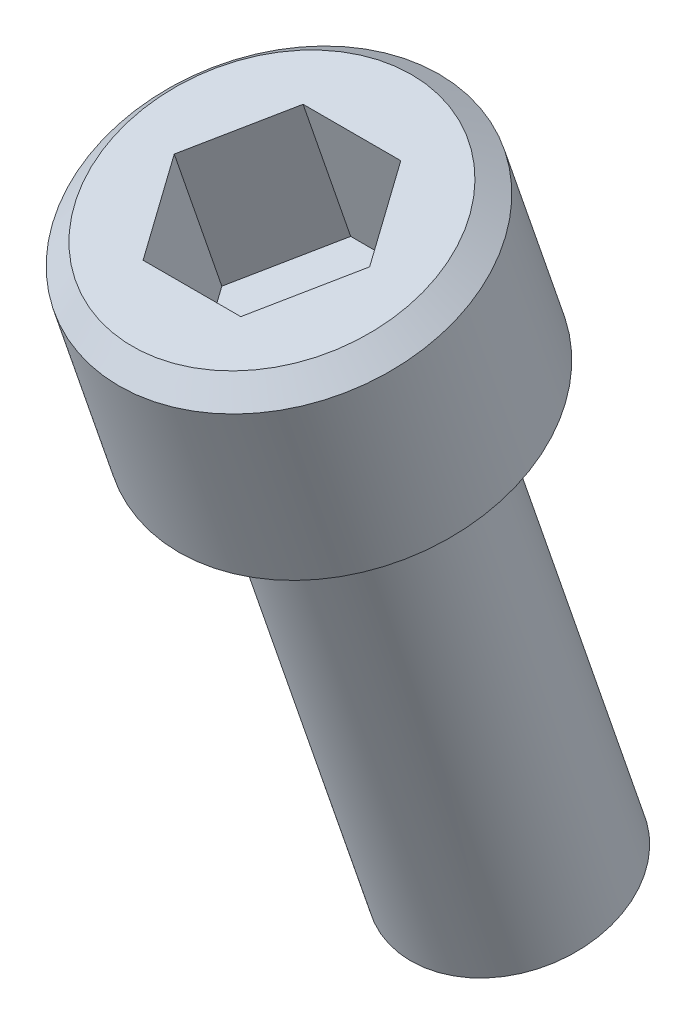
ISO-10303-21;
HEADER;
FILE_DESCRIPTION(('STEP AP214'),'2;1');
FILE_NAME('part.step','',(''),(''),'','','');
FILE_SCHEMA(('AUTOMOTIVE_DESIGN { 1 0 10303 214 1 1 1 1 }'));
ENDSEC;
DATA;
#1=APPLICATION_CONTEXT('core data for automotive mechanical design processes');
#2=APPLICATION_PROTOCOL_DEFINITION('international standard','automotive_design',2000,#1);
#3=PRODUCT_CONTEXT('',#1,'mechanical');
#4=PRODUCT('Part','Part','',(#3));
#5=PRODUCT_RELATED_PRODUCT_CATEGORY('part','',(#4));
#6=PRODUCT_DEFINITION_FORMATION('','',#4);
#7=PRODUCT_DEFINITION_CONTEXT('part definition',#1,'design');
#8=PRODUCT_DEFINITION('design','',#6,#7);
#9=PRODUCT_DEFINITION_SHAPE('','',#8);
#10=(LENGTH_UNIT() NAMED_UNIT(*) SI_UNIT(.MILLI.,.METRE.));
#11=(NAMED_UNIT(*) PLANE_ANGLE_UNIT() SI_UNIT($,.RADIAN.));
#12=(NAMED_UNIT(*) SI_UNIT($,.STERADIAN.) SOLID_ANGLE_UNIT());
#13=UNCERTAINTY_MEASURE_WITH_UNIT(LENGTH_MEASURE(1.E-05),#10,'distance_accuracy_value','');
#14=(GEOMETRIC_REPRESENTATION_CONTEXT(3) GLOBAL_UNCERTAINTY_ASSIGNED_CONTEXT((#13)) GLOBAL_UNIT_ASSIGNED_CONTEXT((#10,
#11,#12)) REPRESENTATION_CONTEXT('',''));
#15=CARTESIAN_POINT('',(0.,0.,0.));
#16=DIRECTION('',(0.,0.,1.));
#17=DIRECTION('',(1.,0.,0.));
#18=AXIS2_PLACEMENT_3D('',#15,#16,#17);
#19=CARTESIAN_POINT('',(-783.822223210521,-239.976630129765,-477.462884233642));
#20=DIRECTION('',(0.,-0.945518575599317,-0.325568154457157));
#21=DIRECTION('',(0.,0.325568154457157,-0.945518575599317));
#22=AXIS2_PLACEMENT_3D('',#19,#20,#21);
#23=PLANE('',#22);
#24=CARTESIAN_POINT('',(-783.822223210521,-239.976630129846,-477.46288423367));
#25=DIRECTION('',(0.,0.945518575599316,0.325568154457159));
#26=DIRECTION('',(0.,-0.325568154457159,0.945518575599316));
#27=AXIS2_PLACEMENT_3D('',#24,#25,#26);
#28=CIRCLE('',#27,1.90499999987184);
#29=CARTESIAN_POINT('',(-783.822223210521,-239.356422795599,-479.264097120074));
#30=VERTEX_POINT('',#29);
#31=CARTESIAN_POINT('',(-783.822223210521,-240.596837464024,-475.661671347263));
#32=VERTEX_POINT('',#31);
#33=EDGE_CURVE('E89',#30,#32,#28,.T.);
#34=ORIENTED_EDGE('',*,*,#33,.F.);
#35=CARTESIAN_POINT('',(-783.822223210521,-239.976630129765,-477.462884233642));
#36=DIRECTION('',(0.,0.945518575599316,0.325568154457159));
#37=DIRECTION('',(0.,-0.325568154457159,0.945518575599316));
#38=AXIS2_PLACEMENT_3D('',#35,#36,#37);
#39=CIRCLE('',#38,1.90499999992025);
#40=EDGE_CURVE('E78',#32,#30,#39,.T.);
#41=ORIENTED_EDGE('',*,*,#40,.F.);
#42=EDGE_LOOP('',(#34,#41));
#43=FACE_BOUND('',#42,.T.);
#44=ADVANCED_FACE('F38',(#43),#23,.T.);
#45=CARTESIAN_POINT('',(-783.822223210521,-239.496306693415,-477.297495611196));
#46=DIRECTION('',(0.,0.945518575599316,0.325568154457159));
#47=DIRECTION('',(0.,-0.325568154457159,0.945518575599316));
#48=AXIS2_PLACEMENT_3D('',#45,#46,#47);
#49=CONICAL_SURFACE('',#48,2.41299999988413,0.785398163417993);
#50=DIRECTION('',(0.,-0.898794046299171,0.43837114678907));
#51=VECTOR('',#50,1.);
#52=CARTESIAN_POINT('',(-783.822223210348,499236.305248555,-244089.821489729));
#53=LINE('',#52,#51);
#54=CARTESIAN_POINT('',(-783.822223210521,-238.710710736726,-479.579031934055));
#55=VERTEX_POINT('',#54);
#56=EDGE_CURVE('E83',#55,#30,#53,.T.);
#57=ORIENTED_EDGE('',*,*,#56,.F.);
#58=CARTESIAN_POINT('',(-783.822223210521,-239.49630669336,-477.297495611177));
#59=DIRECTION('',(0.,0.945518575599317,0.325568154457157));
#60=DIRECTION('',(0.,0.32556815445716,-0.945518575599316));
#61=AXIS2_PLACEMENT_3D('',#58,#59,#60);
#62=CIRCLE('',#61,2.413);
#63=CARTESIAN_POINT('',(-783.822223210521,-240.28190265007,-475.015959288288));
#64=VERTEX_POINT('',#63);
#65=EDGE_CURVE('E91',#64,#55,#62,.T.);
#66=ORIENTED_EDGE('',*,*,#65,.F.);
#67=DIRECTION('',(0.,-0.438371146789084,-0.898794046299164));
#68=VECTOR('',#67,1.);
#69=CARTESIAN_POINT('',(-783.822223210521,243369.960555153,499000.));
#70=LINE('',#69,#68);
#71=EDGE_CURVE('E86',#32,#64,#70,.F.);
#72=ORIENTED_EDGE('',*,*,#71,.F.);
#73=ORIENTED_EDGE('',*,*,#40,.T.);
#74=EDGE_LOOP('',(#57,#66,#72,#73));
#75=FACE_BOUND('',#74,.T.);
#76=ADVANCED_FACE('F81',(#75),#49,.T.);
#77=CARTESIAN_POINT('',(-783.822223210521,-239.496306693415,-477.297495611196));
#78=DIRECTION('',(0.,0.945518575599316,0.325568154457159));
#79=DIRECTION('',(0.,-0.325568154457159,0.945518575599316));
#80=AXIS2_PLACEMENT_3D('',#77,#78,#79);
#81=CONICAL_SURFACE('',#80,2.41299999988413,0.785398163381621);
#82=ORIENTED_EDGE('',*,*,#56,.T.);
#83=ORIENTED_EDGE('',*,*,#33,.T.);
#84=ORIENTED_EDGE('',*,*,#71,.T.);
#85=CARTESIAN_POINT('',(-783.822223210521,-239.49630669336,-477.297495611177));
#86=DIRECTION('',(0.,0.945518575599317,0.325568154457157));
#87=DIRECTION('',(0.,0.32556815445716,-0.945518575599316));
#88=AXIS2_PLACEMENT_3D('',#85,#86,#87);
#89=CIRCLE('',#88,2.413);
#90=EDGE_CURVE('E96',#55,#64,#89,.T.);
#91=ORIENTED_EDGE('',*,*,#90,.F.);
#92=EDGE_LOOP('',(#82,#83,#84,#91));
#93=FACE_BOUND('',#92,.T.);
#94=ADVANCED_FACE('F94',(#93),#81,.T.);
#95=CARTESIAN_POINT('',(-783.822223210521,-226.647654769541,-472.873349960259));
#96=DIRECTION('',(0.,-0.945518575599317,-0.325568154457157));
#97=DIRECTION('',(0.,0.325568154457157,-0.945518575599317));
#98=AXIS2_PLACEMENT_3D('',#95,#96,#97);
#99=PLANE('',#98);
#100=DIRECTION('',(-0.499999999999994,-0.281950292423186,0.818843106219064));
#101=VECTOR('',#100,1.);
#102=CARTESIAN_POINT('',(-784.967902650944,-226.00160546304,-474.749613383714));
#103=LINE('',#102,#101);
#104=CARTESIAN_POINT('',(-784.967902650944,-226.00160546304,-474.749613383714));
#105=VERTEX_POINT('',#104);
#106=CARTESIAN_POINT('',(-786.113582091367,-226.647654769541,-472.873349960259));
#107=VERTEX_POINT('',#106);
#108=EDGE_CURVE('E218',#105,#107,#103,.T.);
#109=ORIENTED_EDGE('',*,*,#108,.T.);
#110=DIRECTION('',(0.500000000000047,-0.281950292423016,0.81884310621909));
#111=VECTOR('',#110,1.);
#112=CARTESIAN_POINT('',(-786.113582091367,-226.647654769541,-472.873349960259));
#113=LINE('',#112,#111);
#114=CARTESIAN_POINT('',(-784.967902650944,-227.293704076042,-470.997086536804));
#115=VERTEX_POINT('',#114);
#116=EDGE_CURVE('E212',#107,#115,#113,.T.);
#117=ORIENTED_EDGE('',*,*,#116,.T.);
#118=DIRECTION('',(1.,0.,0.));
#119=VECTOR('',#118,1.);
#120=CARTESIAN_POINT('',(-782.676543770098,-227.293704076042,-470.997086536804));
#121=LINE('',#120,#119);
#122=CARTESIAN_POINT('',(-782.676543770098,-227.293704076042,-470.997086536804));
#123=VERTEX_POINT('',#122);
#124=EDGE_CURVE('E207',#115,#123,#121,.T.);
#125=ORIENTED_EDGE('',*,*,#124,.T.);
#126=DIRECTION('',(0.500000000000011,0.281950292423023,-0.81884310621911));
#127=VECTOR('',#126,1.);
#128=CARTESIAN_POINT('',(-782.676543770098,-227.293704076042,-470.997086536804));
#129=LINE('',#128,#127);
#130=CARTESIAN_POINT('',(-781.530864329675,-226.647654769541,-472.873349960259));
#131=VERTEX_POINT('',#130);
#132=EDGE_CURVE('E195',#123,#131,#129,.T.);
#133=ORIENTED_EDGE('',*,*,#132,.T.);
#134=DIRECTION('',(-0.499999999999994,0.281950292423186,-0.818843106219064));
#135=VECTOR('',#134,1.);
#136=CARTESIAN_POINT('',(-781.530864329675,-226.647654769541,-472.873349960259));
#137=LINE('',#136,#135);
#138=CARTESIAN_POINT('',(-782.676543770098,-226.00160546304,-474.749613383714));
#139=VERTEX_POINT('',#138);
#140=EDGE_CURVE('E191',#131,#139,#137,.T.);
#141=ORIENTED_EDGE('',*,*,#140,.T.);
#142=DIRECTION('',(1.,0.,0.));
#143=VECTOR('',#142,1.);
#144=CARTESIAN_POINT('',(-784.967902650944,-226.00160546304,-474.749613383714));
#145=LINE('',#144,#143);
#146=EDGE_CURVE('E181',#139,#105,#145,.F.);
#147=ORIENTED_EDGE('',*,*,#146,.T.);
#148=EDGE_LOOP('',(#109,#117,#125,#133,#141,#147));
#149=FACE_BOUND('',#148,.T.);
#150=ADVANCED_FACE('F259',(#149),#99,.F.);
#151=CARTESIAN_POINT('',(-783.822223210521,-239.49630669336,-477.297495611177));
#152=DIRECTION('',(0.,0.945518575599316,0.325568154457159));
#153=DIRECTION('',(0.,-0.325568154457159,0.945518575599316));
#154=AXIS2_PLACEMENT_3D('',#151,#152,#153);
#155=CYLINDRICAL_SURFACE('',#154,2.41300000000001);
#156=ORIENTED_EDGE('',*,*,#65,.T.);
#157=ORIENTED_EDGE('',*,*,#90,.T.);
#158=EDGE_LOOP('',(#156,#157));
#159=FACE_BOUND('',#158,.T.);
#160=CARTESIAN_POINT('',(-783.822223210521,-228.304770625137,-473.443940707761));
#161=DIRECTION('',(0.,0.945518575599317,0.325568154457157));
#162=DIRECTION('',(0.,0.325568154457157,-0.945518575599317));
#163=AXIS2_PLACEMENT_3D('',#160,#161,#162);
#164=CIRCLE('',#163,2.41299999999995);
#165=CARTESIAN_POINT('',(-783.822223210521,-227.519174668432,-475.725477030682));
#166=VERTEX_POINT('',#165);
#167=EDGE_CURVE('E175',#166,#166,#164,.T.);
#168=ORIENTED_EDGE('',*,*,#167,.F.);
#169=EDGE_LOOP('',(#168));
#170=FACE_BOUND('',#169,.T.);
#171=ADVANCED_FACE('F255',(#159,#170),#155,.T.);
#172=CARTESIAN_POINT('',(-782.676543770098,-226.00160546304,-474.749613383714));
#173=DIRECTION('',(0.866025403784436,0.16278407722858,-0.472759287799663));
#174=DIRECTION('',(-0.479150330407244,0.,-0.877732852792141));
#175=AXIS2_PLACEMENT_3D('',#172,#173,#174);
#176=PLANE('',#175);
#177=DIRECTION('',(0.,0.945518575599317,0.325568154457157));
#178=VECTOR('',#177,1.);
#179=CARTESIAN_POINT('',(-782.676543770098,-226.00160546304,-474.749613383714));
#180=LINE('',#179,#178);
#181=CARTESIAN_POINT('',(-782.676543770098,-222.75942226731,-473.63324018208));
#182=VERTEX_POINT('',#181);
#183=EDGE_CURVE('E224',#182,#139,#180,.F.);
#184=ORIENTED_EDGE('',*,*,#183,.T.);
#185=ORIENTED_EDGE('',*,*,#140,.F.);
#186=DIRECTION('',(0.,0.945518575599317,0.325568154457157));
#187=VECTOR('',#186,1.);
#188=CARTESIAN_POINT('',(-781.530864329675,-226.647654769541,-472.873349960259));
#189=LINE('',#188,#187);
#190=CARTESIAN_POINT('',(-781.530864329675,-223.405471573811,-471.756976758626));
#191=VERTEX_POINT('',#190);
#192=EDGE_CURVE('E203',#131,#191,#189,.T.);
#193=ORIENTED_EDGE('',*,*,#192,.T.);
#194=DIRECTION('',(0.499999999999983,-0.281950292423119,0.818843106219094));
#195=VECTOR('',#194,1.);
#196=CARTESIAN_POINT('',(-782.676543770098,-222.75942226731,-473.63324018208));
#197=LINE('',#196,#195);
#198=EDGE_CURVE('E174',#182,#191,#197,.T.);
#199=ORIENTED_EDGE('',*,*,#198,.F.);
#200=EDGE_LOOP('',(#184,#185,#193,#199));
#201=FACE_BOUND('',#200,.T.);
#202=ADVANCED_FACE('F251',(#201),#176,.F.);
#203=CARTESIAN_POINT('',(-781.530864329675,-226.647654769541,-472.873349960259));
#204=DIRECTION('',(0.866025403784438,-0.162784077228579,0.47275928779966));
#205=DIRECTION('',(0.47915033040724,0.,-0.877732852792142));
#206=AXIS2_PLACEMENT_3D('',#203,#204,#205);
#207=PLANE('',#206);
#208=ORIENTED_EDGE('',*,*,#192,.F.);
#209=ORIENTED_EDGE('',*,*,#132,.F.);
#210=DIRECTION('',(0.,-0.945518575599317,-0.325568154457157));
#211=VECTOR('',#210,1.);
#212=CARTESIAN_POINT('',(-782.676543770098,-227.293704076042,-470.997086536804));
#213=LINE('',#212,#211);
#214=CARTESIAN_POINT('',(-782.676543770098,-224.051520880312,-469.880713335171));
#215=VERTEX_POINT('',#214);
#216=EDGE_CURVE('E209',#123,#215,#213,.F.);
#217=ORIENTED_EDGE('',*,*,#216,.T.);
#218=DIRECTION('',(-0.499999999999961,-0.281950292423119,0.818843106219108));
#219=VECTOR('',#218,1.);
#220=CARTESIAN_POINT('',(-781.530864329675,-223.405471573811,-471.756976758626));
#221=LINE('',#220,#219);
#222=EDGE_CURVE('E171',#191,#215,#221,.T.);
#223=ORIENTED_EDGE('',*,*,#222,.F.);
#224=EDGE_LOOP('',(#208,#209,#217,#223));
#225=FACE_BOUND('',#224,.T.);
#226=ADVANCED_FACE('F247',(#225),#207,.F.);
#227=CARTESIAN_POINT('',(-782.676543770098,-227.293704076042,-470.997086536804));
#228=DIRECTION('',(0.,-0.325568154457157,0.945518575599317));
#229=DIRECTION('',(0.,-0.945518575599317,-0.325568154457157));
#230=AXIS2_PLACEMENT_3D('',#227,#228,#229);
#231=PLANE('',#230);
#232=ORIENTED_EDGE('',*,*,#216,.F.);
#233=ORIENTED_EDGE('',*,*,#124,.F.);
#234=DIRECTION('',(0.,0.945518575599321,0.325568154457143));
#235=VECTOR('',#234,1.);
#236=CARTESIAN_POINT('',(-784.967902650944,-227.293704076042,-470.997086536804));
#237=LINE('',#236,#235);
#238=CARTESIAN_POINT('',(-784.967902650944,-224.051520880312,-469.880713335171));
#239=VERTEX_POINT('',#238);
#240=EDGE_CURVE('E215',#115,#239,#237,.T.);
#241=ORIENTED_EDGE('',*,*,#240,.T.);
#242=DIRECTION('',(1.,0.,0.));
#243=VECTOR('',#242,1.);
#244=CARTESIAN_POINT('',(-783.822223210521,-224.051520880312,-469.880713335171));
#245=LINE('',#244,#243);
#246=EDGE_CURVE('E166',#215,#239,#245,.F.);
#247=ORIENTED_EDGE('',*,*,#246,.F.);
#248=EDGE_LOOP('',(#232,#233,#241,#247));
#249=FACE_BOUND('',#248,.T.);
#250=ADVANCED_FACE('F243',(#249),#231,.F.);
#251=CARTESIAN_POINT('',(-784.967902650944,-227.293704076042,-470.997086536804));
#252=DIRECTION('',(-0.866025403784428,-0.162784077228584,0.472759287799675));
#253=DIRECTION('',(0.479150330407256,0.,0.877732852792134));
#254=AXIS2_PLACEMENT_3D('',#251,#252,#253);
#255=PLANE('',#254);
#256=ORIENTED_EDGE('',*,*,#240,.F.);
#257=ORIENTED_EDGE('',*,*,#116,.F.);
#258=DIRECTION('',(0.,0.945518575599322,0.325568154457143));
#259=VECTOR('',#258,1.);
#260=CARTESIAN_POINT('',(-786.113582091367,-226.647654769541,-472.873349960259));
#261=LINE('',#260,#259);
#262=CARTESIAN_POINT('',(-786.113582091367,-223.405471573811,-471.756976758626));
#263=VERTEX_POINT('',#262);
#264=EDGE_CURVE('E221',#107,#263,#261,.T.);
#265=ORIENTED_EDGE('',*,*,#264,.T.);
#266=DIRECTION('',(-0.499999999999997,0.281950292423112,-0.818843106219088));
#267=VECTOR('',#266,1.);
#268=CARTESIAN_POINT('',(-784.967902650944,-224.051520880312,-469.880713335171));
#269=LINE('',#268,#267);
#270=EDGE_CURVE('E159',#239,#263,#269,.T.);
#271=ORIENTED_EDGE('',*,*,#270,.F.);
#272=EDGE_LOOP('',(#256,#257,#265,#271));
#273=FACE_BOUND('',#272,.T.);
#274=ADVANCED_FACE('F240',(#273),#255,.F.);
#275=CARTESIAN_POINT('',(-786.113582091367,-226.647654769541,-472.873349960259));
#276=DIRECTION('',(-0.866025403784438,0.162784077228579,-0.47275928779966));
#277=DIRECTION('',(-0.47915033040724,0.,0.877732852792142));
#278=AXIS2_PLACEMENT_3D('',#275,#276,#277);
#279=PLANE('',#278);
#280=ORIENTED_EDGE('',*,*,#264,.F.);
#281=ORIENTED_EDGE('',*,*,#108,.F.);
#282=DIRECTION('',(0.,0.945518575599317,0.325568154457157));
#283=VECTOR('',#282,1.);
#284=CARTESIAN_POINT('',(-784.967902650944,-226.00160546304,-474.749613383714));
#285=LINE('',#284,#283);
#286=CARTESIAN_POINT('',(-784.967902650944,-222.75942226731,-473.63324018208));
#287=VERTEX_POINT('',#286);
#288=EDGE_CURVE('E178',#105,#287,#285,.T.);
#289=ORIENTED_EDGE('',*,*,#288,.T.);
#290=DIRECTION('',(0.500000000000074,0.281950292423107,-0.818843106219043));
#291=VECTOR('',#290,1.);
#292=CARTESIAN_POINT('',(-786.113582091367,-223.405471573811,-471.756976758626));
#293=LINE('',#292,#291);
#294=EDGE_CURVE('E152',#263,#287,#293,.T.);
#295=ORIENTED_EDGE('',*,*,#294,.F.);
#296=EDGE_LOOP('',(#280,#281,#289,#295));
#297=FACE_BOUND('',#296,.T.);
#298=ADVANCED_FACE('F236',(#297),#279,.F.);
#299=CARTESIAN_POINT('',(-784.967902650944,-226.00160546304,-474.749613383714));
#300=DIRECTION('',(0.,0.325568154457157,-0.945518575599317));
#301=DIRECTION('',(0.,0.945518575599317,0.325568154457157));
#302=AXIS2_PLACEMENT_3D('',#299,#300,#301);
#303=PLANE('',#302);
#304=ORIENTED_EDGE('',*,*,#288,.F.);
#305=ORIENTED_EDGE('',*,*,#146,.F.);
#306=ORIENTED_EDGE('',*,*,#183,.F.);
#307=DIRECTION('',(1.,0.,0.));
#308=VECTOR('',#307,1.);
#309=CARTESIAN_POINT('',(-783.822223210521,-222.75942226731,-473.63324018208));
#310=LINE('',#309,#308);
#311=EDGE_CURVE('E113',#287,#182,#310,.T.);
#312=ORIENTED_EDGE('',*,*,#311,.F.);
#313=EDGE_LOOP('',(#304,#305,#306,#312));
#314=FACE_BOUND('',#313,.T.);
#315=ADVANCED_FACE('F232',(#314),#303,.F.);
#316=CARTESIAN_POINT('',(-783.822223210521,-228.304770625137,-473.443940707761));
#317=DIRECTION('',(0.,0.945518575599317,0.325568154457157));
#318=DIRECTION('',(0.,0.325568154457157,-0.945518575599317));
#319=AXIS2_PLACEMENT_3D('',#316,#317,#318);
#320=TOROIDAL_SURFACE('',#319,2.76859999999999,0.3556);
#321=CARTESIAN_POINT('',(-783.822223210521,-227.968544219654,-473.328168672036));
#322=DIRECTION('',(0.,-0.945518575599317,-0.325568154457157));
#323=DIRECTION('',(0.,0.325568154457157,-0.945518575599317));
#324=AXIS2_PLACEMENT_3D('',#321,#322,#323);
#325=CIRCLE('',#324,2.76860000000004);
#326=CARTESIAN_POINT('',(-783.822223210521,-228.869912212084,-470.710405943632));
#327=VERTEX_POINT('',#326);
#328=CARTESIAN_POINT('',(-783.822223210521,-227.067176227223,-475.94593140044));
#329=VERTEX_POINT('',#328);
#330=EDGE_CURVE('E108',#327,#329,#325,.F.);
#331=ORIENTED_EDGE('',*,*,#330,.F.);
#332=CARTESIAN_POINT('',(-783.822223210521,-227.968544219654,-473.328168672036));
#333=DIRECTION('',(0.,-0.945518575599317,-0.325568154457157));
#334=DIRECTION('',(0.,-0.32556815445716,0.945518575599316));
#335=AXIS2_PLACEMENT_3D('',#332,#333,#334);
#336=CIRCLE('',#335,2.76859999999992);
#337=EDGE_CURVE('E58',#329,#327,#336,.F.);
#338=ORIENTED_EDGE('',*,*,#337,.F.);
#339=EDGE_LOOP('',(#331,#338));
#340=FACE_BOUND('',#339,.T.);
#341=ORIENTED_EDGE('',*,*,#167,.T.);
#342=EDGE_LOOP('',(#341));
#343=FACE_BOUND('',#342,.T.);
#344=ADVANCED_FACE('F109',(#340,#343),#320,.F.);
#345=CARTESIAN_POINT('',(-783.822223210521,-223.405471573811,-471.756976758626));
#346=DIRECTION('',(0.,0.945518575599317,0.325568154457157));
#347=DIRECTION('',(0.,-0.325568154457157,0.945518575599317));
#348=AXIS2_PLACEMENT_3D('',#345,#346,#347);
#349=PLANE('',#348);
#350=CARTESIAN_POINT('',(-783.822223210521,-223.405471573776,-471.756976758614));
#351=DIRECTION('',(0.,-0.945518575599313,-0.325568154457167));
#352=DIRECTION('',(0.,0.325568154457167,-0.945518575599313));
#353=AXIS2_PLACEMENT_3D('',#350,#351,#352);
#354=CIRCLE('',#353,3.46074999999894);
#355=CARTESIAN_POINT('',(-783.822223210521,-222.278761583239,-475.029180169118));
#356=VERTEX_POINT('',#355);
#357=EDGE_CURVE('E106',#356,#356,#354,.T.);
#358=ORIENTED_EDGE('',*,*,#357,.F.);
#359=EDGE_LOOP('',(#358));
#360=FACE_BOUND('',#359,.T.);
#361=ORIENTED_EDGE('',*,*,#294,.T.);
#362=ORIENTED_EDGE('',*,*,#311,.T.);
#363=ORIENTED_EDGE('',*,*,#198,.T.);
#364=ORIENTED_EDGE('',*,*,#222,.T.);
#365=ORIENTED_EDGE('',*,*,#246,.T.);
#366=ORIENTED_EDGE('',*,*,#270,.T.);
#367=EDGE_LOOP('',(#361,#362,#363,#364,#365,#366));
#368=FACE_BOUND('',#367,.T.);
#369=ADVANCED_FACE('F133',(#360,#368),#349,.T.);
#370=CARTESIAN_POINT('',(-783.822223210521,-227.968544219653,-473.328168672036));
#371=DIRECTION('',(0.,-0.945518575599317,-0.325568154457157));
#372=DIRECTION('',(0.,0.325568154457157,-0.945518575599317));
#373=AXIS2_PLACEMENT_3D('',#370,#371,#372);
#374=PLANE('',#373);
#375=ORIENTED_EDGE('',*,*,#330,.T.);
#376=ORIENTED_EDGE('',*,*,#337,.T.);
#377=EDGE_LOOP('',(#375,#376));
#378=FACE_BOUND('',#377,.T.);
#379=CARTESIAN_POINT('',(-783.822223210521,-227.968544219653,-473.328168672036));
#380=DIRECTION('',(0.,0.945518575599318,0.325568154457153));
#381=DIRECTION('',(0.,-0.325568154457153,0.945518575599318));
#382=AXIS2_PLACEMENT_3D('',#379,#380,#381);
#383=CIRCLE('',#382,3.96875000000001);
#384=CARTESIAN_POINT('',(-783.822223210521,-229.260642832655,-469.575641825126));
#385=VERTEX_POINT('',#384);
#386=EDGE_CURVE('E50',#385,#385,#383,.T.);
#387=ORIENTED_EDGE('',*,*,#386,.F.);
#388=EDGE_LOOP('',(#387));
#389=FACE_BOUND('',#388,.T.);
#390=ADVANCED_FACE('F115',(#378,#389),#374,.T.);
#391=CARTESIAN_POINT('',(-783.822223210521,-223.88579501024,-471.922365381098));
#392=DIRECTION('',(0.,-0.945518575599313,-0.325568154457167));
#393=DIRECTION('',(0.,0.325568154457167,-0.945518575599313));
#394=AXIS2_PLACEMENT_3D('',#391,#392,#393);
#395=CONICAL_SURFACE('',#394,3.96875000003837,0.785398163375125);
#396=ORIENTED_EDGE('',*,*,#357,.T.);
#397=EDGE_LOOP('',(#396));
#398=FACE_BOUND('',#397,.T.);
#399=CARTESIAN_POINT('',(-783.822223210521,-223.885795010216,-471.92236538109));
#400=DIRECTION('',(0.,0.945518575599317,0.325568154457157));
#401=DIRECTION('',(0.,0.325568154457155,-0.945518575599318));
#402=AXIS2_PLACEMENT_3D('',#399,#400,#401);
#403=CIRCLE('',#402,3.96875);
#404=CARTESIAN_POINT('',(-783.822223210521,-222.593696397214,-475.674892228));
#405=VERTEX_POINT('',#404);
#406=EDGE_CURVE('E11',#405,#405,#403,.F.);
#407=ORIENTED_EDGE('',*,*,#406,.F.);
#408=EDGE_LOOP('',(#407));
#409=FACE_BOUND('',#408,.T.);
#410=ADVANCED_FACE('F132',(#398,#409),#395,.T.);
#411=CARTESIAN_POINT('',(-783.822223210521,-227.968544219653,-473.328168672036));
#412=DIRECTION('',(0.,0.945518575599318,0.325568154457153));
#413=DIRECTION('',(0.,-0.325568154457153,0.945518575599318));
#414=AXIS2_PLACEMENT_3D('',#411,#412,#413);
#415=CYLINDRICAL_SURFACE('',#414,3.96875000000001);
#416=ORIENTED_EDGE('',*,*,#386,.T.);
#417=EDGE_LOOP('',(#416));
#418=FACE_BOUND('',#417,.T.);
#419=ORIENTED_EDGE('',*,*,#406,.T.);
#420=EDGE_LOOP('',(#419));
#421=FACE_BOUND('',#420,.T.);
#422=ADVANCED_FACE('F40',(#418,#421),#415,.T.);
#423=CLOSED_SHELL('',(#44,#76,#94,#150,#171,#202,#226,#250,#274,#298,#315,#344,#369,#390,#410,#422));
#424=MANIFOLD_SOLID_BREP('B2',#423);
#425=ADVANCED_BREP_SHAPE_REPRESENTATION('',(#18,#424),#14);
#426=SHAPE_DEFINITION_REPRESENTATION(#9,#425);
ENDSEC;
END-ISO-10303-21;
